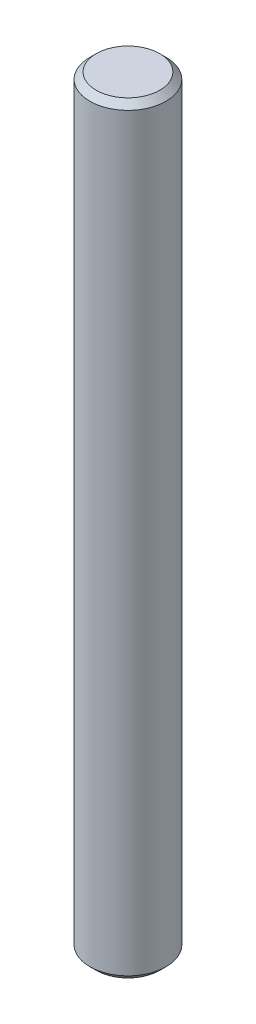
from build123d import *

# Parameters (mm, degrees)
SKETCH_1_R      = 1.5
EXTRUDE_1_DEPTH = 15
CHAMFER_1_SIZE  = 0.25


with BuildPart() as part:
    # Sketch 1 → Extrude 1 (new, symmetric)
    with BuildSketch(Plane(origin=(0, 0, 0), x_dir=(1, 0, 0), z_dir=(0, 1, 0))):
        with Locations(Location((0, 0, 0), (0, 0, 270))):
            Circle(SKETCH_1_R)
    extrude(amount=EXTRUDE_1_DEPTH, both=True)

    # Chamfer 1
    chamfer_1_edges = [part.edges().sort_by_distance(p)[0] for p in [
        (0, -15, -1.5),
        (0, 15, -1.5),
    ]]
    chamfer(chamfer_1_edges, length=CHAMFER_1_SIZE)


solid = part.part
